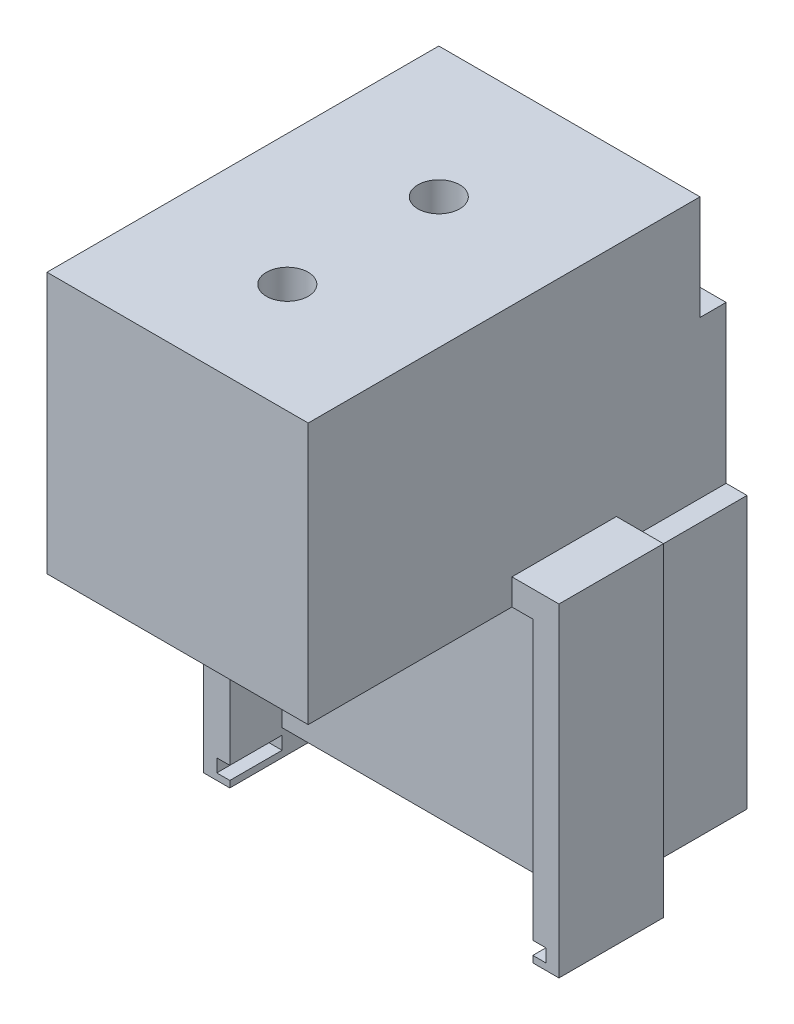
ISO-10303-21;
HEADER;
FILE_DESCRIPTION(('STEP AP214'),'2;1');
FILE_NAME('part.step','',(''),(''),'','','');
FILE_SCHEMA(('AUTOMOTIVE_DESIGN { 1 0 10303 214 1 1 1 1 }'));
ENDSEC;
DATA;
#1=APPLICATION_CONTEXT('core data for automotive mechanical design processes');
#2=APPLICATION_PROTOCOL_DEFINITION('international standard','automotive_design',2000,#1);
#3=PRODUCT_CONTEXT('',#1,'mechanical');
#4=PRODUCT('Part','Part','',(#3));
#5=PRODUCT_RELATED_PRODUCT_CATEGORY('part','',(#4));
#6=PRODUCT_DEFINITION_FORMATION('','',#4);
#7=PRODUCT_DEFINITION_CONTEXT('part definition',#1,'design');
#8=PRODUCT_DEFINITION('design','',#6,#7);
#9=PRODUCT_DEFINITION_SHAPE('','',#8);
#10=(LENGTH_UNIT() NAMED_UNIT(*) SI_UNIT(.MILLI.,.METRE.));
#11=(NAMED_UNIT(*) PLANE_ANGLE_UNIT() SI_UNIT($,.RADIAN.));
#12=(NAMED_UNIT(*) SI_UNIT($,.STERADIAN.) SOLID_ANGLE_UNIT());
#13=UNCERTAINTY_MEASURE_WITH_UNIT(LENGTH_MEASURE(1.E-05),#10,'distance_accuracy_value','');
#14=(GEOMETRIC_REPRESENTATION_CONTEXT(3) GLOBAL_UNCERTAINTY_ASSIGNED_CONTEXT((#13)) GLOBAL_UNIT_ASSIGNED_CONTEXT((#10,
#11,#12)) REPRESENTATION_CONTEXT('',''));
#15=CARTESIAN_POINT('',(0.,0.,0.));
#16=DIRECTION('',(0.,0.,1.));
#17=DIRECTION('',(1.,0.,0.));
#18=AXIS2_PLACEMENT_3D('',#15,#16,#17);
#19=CARTESIAN_POINT('',(0.,50.,0.));
#20=DIRECTION('',(1.,0.,0.));
#21=DIRECTION('',(0.,0.,-1.));
#22=AXIS2_PLACEMENT_3D('',#19,#20,#21);
#23=PLANE('',#22);
#24=DIRECTION('',(0.,1.,0.));
#25=VECTOR('',#24,1.);
#26=CARTESIAN_POINT('',(0.,5.,-59.));
#27=LINE('',#26,#25);
#28=CARTESIAN_POINT('',(0.,0.,-59.));
#29=VERTEX_POINT('',#28);
#30=CARTESIAN_POINT('',(0.,5.,-59.));
#31=VERTEX_POINT('',#30);
#32=EDGE_CURVE('E446',#29,#31,#27,.T.);
#33=ORIENTED_EDGE('',*,*,#32,.T.);
#34=DIRECTION('',(0.,0.,1.));
#35=VECTOR('',#34,1.);
#36=CARTESIAN_POINT('',(0.,5.,-59.));
#37=LINE('',#36,#35);
#38=CARTESIAN_POINT('',(0.,5.,-39.));
#39=VERTEX_POINT('',#38);
#40=EDGE_CURVE('E485',#31,#39,#37,.T.);
#41=ORIENTED_EDGE('',*,*,#40,.T.);
#42=DIRECTION('',(0.,1.,0.));
#43=VECTOR('',#42,1.);
#44=CARTESIAN_POINT('',(0.,5.,-39.));
#45=LINE('',#44,#43);
#46=CARTESIAN_POINT('',(0.,0.,-39.));
#47=VERTEX_POINT('',#46);
#48=EDGE_CURVE('E407',#47,#39,#45,.T.);
#49=ORIENTED_EDGE('',*,*,#48,.F.);
#50=DIRECTION('',(0.,0.,1.));
#51=VECTOR('',#50,1.);
#52=CARTESIAN_POINT('',(0.,0.,0.));
#53=LINE('',#52,#51);
#54=CARTESIAN_POINT('',(0.,0.,0.));
#55=VERTEX_POINT('',#54);
#56=EDGE_CURVE('E596',#47,#55,#53,.T.);
#57=ORIENTED_EDGE('',*,*,#56,.T.);
#58=DIRECTION('',(0.,-1.,0.));
#59=VECTOR('',#58,1.);
#60=CARTESIAN_POINT('',(0.,50.,0.));
#61=LINE('',#60,#59);
#62=CARTESIAN_POINT('',(0.,50.,0.));
#63=VERTEX_POINT('',#62);
#64=EDGE_CURVE('E607',#63,#55,#61,.T.);
#65=ORIENTED_EDGE('',*,*,#64,.F.);
#66=DIRECTION('',(0.,0.,1.));
#67=VECTOR('',#66,1.);
#68=CARTESIAN_POINT('',(0.,50.,0.));
#69=LINE('',#68,#67);
#70=CARTESIAN_POINT('',(0.,50.,-75.));
#71=VERTEX_POINT('',#70);
#72=EDGE_CURVE('E584',#71,#63,#69,.T.);
#73=ORIENTED_EDGE('',*,*,#72,.F.);
#74=DIRECTION('',(0.,1.,0.));
#75=VECTOR('',#74,1.);
#76=CARTESIAN_POINT('',(0.,50.,-75.));
#77=LINE('',#76,#75);
#78=CARTESIAN_POINT('',(0.,30.,-75.));
#79=VERTEX_POINT('',#78);
#80=EDGE_CURVE('E546',#79,#71,#77,.T.);
#81=ORIENTED_EDGE('',*,*,#80,.F.);
#82=DIRECTION('',(0.,0.,1.));
#83=VECTOR('',#82,1.);
#84=CARTESIAN_POINT('',(0.,30.,-75.));
#85=LINE('',#84,#83);
#86=CARTESIAN_POINT('',(0.,30.,-80.));
#87=VERTEX_POINT('',#86);
#88=EDGE_CURVE('E552',#87,#79,#85,.T.);
#89=ORIENTED_EDGE('',*,*,#88,.F.);
#90=DIRECTION('',(0.,-1.,0.));
#91=VECTOR('',#90,1.);
#92=CARTESIAN_POINT('',(0.,50.,-80.));
#93=LINE('',#92,#91);
#94=CARTESIAN_POINT('',(0.,0.,-80.));
#95=VERTEX_POINT('',#94);
#96=EDGE_CURVE('E611',#87,#95,#93,.T.);
#97=ORIENTED_EDGE('',*,*,#96,.T.);
#98=EDGE_CURVE('E597',#95,#29,#53,.T.);
#99=ORIENTED_EDGE('',*,*,#98,.T.);
#100=EDGE_LOOP('',(#33,#41,#49,#57,#65,#73,#81,#89,#97,#99));
#101=FACE_BOUND('',#100,.T.);
#102=ADVANCED_FACE('F47',(#101),#23,.F.);
#103=CARTESIAN_POINT('',(54.,0.,-80.));
#104=DIRECTION('',(0.,-1.,0.));
#105=DIRECTION('',(0.,0.,-1.));
#106=AXIS2_PLACEMENT_3D('',#103,#104,#105);
#107=PLANE('',#106);
#108=DIRECTION('',(1.,0.,0.));
#109=VECTOR('',#108,1.);
#110=CARTESIAN_POINT('',(0.,0.,-59.));
#111=LINE('',#110,#109);
#112=CARTESIAN_POINT('',(-3.99999999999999,0.,-59.));
#113=VERTEX_POINT('',#112);
#114=EDGE_CURVE('E442',#113,#29,#111,.T.);
#115=ORIENTED_EDGE('',*,*,#114,.T.);
#116=ORIENTED_EDGE('',*,*,#98,.F.);
#117=DIRECTION('',(-1.,0.,0.));
#118=VECTOR('',#117,1.);
#119=CARTESIAN_POINT('',(54.,0.,-80.));
#120=LINE('',#119,#118);
#121=CARTESIAN_POINT('',(-4.,0.,-80.));
#122=VERTEX_POINT('',#121);
#123=EDGE_CURVE('E538',#95,#122,#120,.T.);
#124=ORIENTED_EDGE('',*,*,#123,.T.);
#125=DIRECTION('',(0.,0.,1.));
#126=VECTOR('',#125,1.);
#127=CARTESIAN_POINT('',(-4.,0.,-80.));
#128=LINE('',#127,#126);
#129=EDGE_CURVE('E503',#122,#113,#128,.T.);
#130=ORIENTED_EDGE('',*,*,#129,.T.);
#131=EDGE_LOOP('',(#115,#116,#124,#130));
#132=FACE_BOUND('',#131,.T.);
#133=ADVANCED_FACE('F672',(#132),#107,.F.);
#134=CARTESIAN_POINT('',(-3.99999999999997,0.,0.));
#135=DIRECTION('',(-1.,0.,0.));
#136=DIRECTION('',(0.,0.,1.));
#137=AXIS2_PLACEMENT_3D('',#134,#135,#136);
#138=PLANE('',#137);
#139=DIRECTION('',(0.,0.,-1.));
#140=VECTOR('',#139,1.);
#141=CARTESIAN_POINT('',(-4.,-52.,-80.));
#142=LINE('',#141,#140);
#143=CARTESIAN_POINT('',(-3.99999999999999,-52.,-59.));
#144=VERTEX_POINT('',#143);
#145=CARTESIAN_POINT('',(-4.,-52.,-80.));
#146=VERTEX_POINT('',#145);
#147=EDGE_CURVE('E511',#144,#146,#142,.T.);
#148=ORIENTED_EDGE('',*,*,#147,.F.);
#149=DIRECTION('',(0.,1.,0.));
#150=VECTOR('',#149,1.);
#151=CARTESIAN_POINT('',(-3.99999999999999,0.,-59.));
#152=LINE('',#151,#150);
#153=EDGE_CURVE('E12',#144,#113,#152,.T.);
#154=ORIENTED_EDGE('',*,*,#153,.T.);
#155=ORIENTED_EDGE('',*,*,#129,.F.);
#156=DIRECTION('',(0.,1.,0.));
#157=VECTOR('',#156,1.);
#158=CARTESIAN_POINT('',(-4.,0.,-80.));
#159=LINE('',#158,#157);
#160=EDGE_CURVE('E499',#146,#122,#159,.T.);
#161=ORIENTED_EDGE('',*,*,#160,.F.);
#162=EDGE_LOOP('',(#148,#154,#155,#161));
#163=FACE_BOUND('',#162,.T.);
#164=ADVANCED_FACE('F670',(#163),#138,.T.);
#165=CARTESIAN_POINT('',(25.,50.,-21.));
#166=DIRECTION('',(0.,-1.,0.));
#167=DIRECTION('',(0.,0.,-1.));
#168=AXIS2_PLACEMENT_3D('',#165,#166,#167);
#169=CYLINDRICAL_SURFACE('',#168,4.);
#170=CARTESIAN_POINT('',(25.,50.,-21.));
#171=DIRECTION('',(0.,1.,0.));
#172=DIRECTION('',(0.,0.,1.));
#173=AXIS2_PLACEMENT_3D('',#170,#171,#172);
#174=CIRCLE('',#173,4.);
#175=CARTESIAN_POINT('',(25.,50.,-17.));
#176=VERTEX_POINT('',#175);
#177=EDGE_CURVE('E572',#176,#176,#174,.T.);
#178=ORIENTED_EDGE('',*,*,#177,.T.);
#179=EDGE_LOOP('',(#178));
#180=FACE_BOUND('',#179,.T.);
#181=CARTESIAN_POINT('',(25.,25.,-21.));
#182=DIRECTION('',(0.,-1.,0.));
#183=DIRECTION('',(0.,0.,-1.));
#184=AXIS2_PLACEMENT_3D('',#181,#182,#183);
#185=CIRCLE('',#184,4.);
#186=CARTESIAN_POINT('',(25.,25.,-25.));
#187=VERTEX_POINT('',#186);
#188=EDGE_CURVE('E495',#187,#187,#185,.T.);
#189=ORIENTED_EDGE('',*,*,#188,.T.);
#190=EDGE_LOOP('',(#189));
#191=FACE_BOUND('',#190,.T.);
#192=ADVANCED_FACE('F49',(#180,#191),#169,.F.);
#193=CARTESIAN_POINT('',(0.,0.,0.));
#194=DIRECTION('',(0.,1.,0.));
#195=DIRECTION('',(0.,0.,1.));
#196=AXIS2_PLACEMENT_3D('',#193,#194,#195);
#197=PLANE('',#196);
#198=CARTESIAN_POINT('',(25.,0.,-21.));
#199=DIRECTION('',(0.,-1.,0.));
#200=DIRECTION('',(0.,0.,-1.));
#201=AXIS2_PLACEMENT_3D('',#198,#199,#200);
#202=CIRCLE('',#201,7.5);
#203=CARTESIAN_POINT('',(25.,0.,-28.5));
#204=VERTEX_POINT('',#203);
#205=EDGE_CURVE('E466',#204,#204,#202,.T.);
#206=ORIENTED_EDGE('',*,*,#205,.F.);
#207=EDGE_LOOP('',(#206));
#208=FACE_BOUND('',#207,.T.);
#209=DIRECTION('',(-1.,0.,0.));
#210=VECTOR('',#209,1.);
#211=CARTESIAN_POINT('',(54.,0.,-49.));
#212=LINE('',#211,#210);
#213=CARTESIAN_POINT('',(54.,0.,-49.));
#214=VERTEX_POINT('',#213);
#215=CARTESIAN_POINT('',(-3.99999999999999,0.,-49.));
#216=VERTEX_POINT('',#215);
#217=EDGE_CURVE('E56',#214,#216,#212,.T.);
#218=ORIENTED_EDGE('',*,*,#217,.F.);
#219=DIRECTION('',(0.,0.,1.));
#220=VECTOR('',#219,1.);
#221=CARTESIAN_POINT('',(54.,0.,-59.));
#222=LINE('',#221,#220);
#223=CARTESIAN_POINT('',(54.,0.,-39.));
#224=VERTEX_POINT('',#223);
#225=EDGE_CURVE('E324',#214,#224,#222,.T.);
#226=ORIENTED_EDGE('',*,*,#225,.T.);
#227=DIRECTION('',(1.,0.,0.));
#228=VECTOR('',#227,1.);
#229=CARTESIAN_POINT('',(50.,0.,-39.));
#230=LINE('',#229,#228);
#231=CARTESIAN_POINT('',(50.,0.,-39.));
#232=VERTEX_POINT('',#231);
#233=EDGE_CURVE('E377',#232,#224,#230,.T.);
#234=ORIENTED_EDGE('',*,*,#233,.F.);
#235=DIRECTION('',(0.,0.,1.));
#236=VECTOR('',#235,1.);
#237=CARTESIAN_POINT('',(50.,0.,0.));
#238=LINE('',#237,#236);
#239=CARTESIAN_POINT('',(50.,0.,0.));
#240=VERTEX_POINT('',#239);
#241=EDGE_CURVE('E565',#232,#240,#238,.T.);
#242=ORIENTED_EDGE('',*,*,#241,.T.);
#243=DIRECTION('',(1.,0.,0.));
#244=VECTOR('',#243,1.);
#245=CARTESIAN_POINT('',(0.,0.,0.));
#246=LINE('',#245,#244);
#247=EDGE_CURVE('E577',#55,#240,#246,.T.);
#248=ORIENTED_EDGE('',*,*,#247,.F.);
#249=ORIENTED_EDGE('',*,*,#56,.F.);
#250=DIRECTION('',(1.,0.,0.));
#251=VECTOR('',#250,1.);
#252=CARTESIAN_POINT('',(0.,0.,-39.));
#253=LINE('',#252,#251);
#254=CARTESIAN_POINT('',(-3.99999999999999,0.,-39.));
#255=VERTEX_POINT('',#254);
#256=EDGE_CURVE('E404',#255,#47,#253,.T.);
#257=ORIENTED_EDGE('',*,*,#256,.F.);
#258=DIRECTION('',(0.,0.,1.));
#259=VECTOR('',#258,1.);
#260=CARTESIAN_POINT('',(-3.99999999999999,0.,-59.));
#261=LINE('',#260,#259);
#262=EDGE_CURVE('E462',#216,#255,#261,.T.);
#263=ORIENTED_EDGE('',*,*,#262,.F.);
#264=EDGE_LOOP('',(#218,#226,#234,#242,#248,#249,#257,#263));
#265=FACE_BOUND('',#264,.T.);
#266=ADVANCED_FACE('F638',(#208,#265),#197,.F.);
#267=CARTESIAN_POINT('',(50.,50.,0.));
#268=DIRECTION('',(1.,0.,0.));
#269=DIRECTION('',(0.,0.,-1.));
#270=AXIS2_PLACEMENT_3D('',#267,#268,#269);
#271=PLANE('',#270);
#272=DIRECTION('',(0.,-1.,0.));
#273=VECTOR('',#272,1.);
#274=CARTESIAN_POINT('',(50.,5.,-59.));
#275=LINE('',#274,#273);
#276=CARTESIAN_POINT('',(50.,5.,-59.));
#277=VERTEX_POINT('',#276);
#278=CARTESIAN_POINT('',(50.,0.,-59.));
#279=VERTEX_POINT('',#278);
#280=EDGE_CURVE('E343',#277,#279,#275,.T.);
#281=ORIENTED_EDGE('',*,*,#280,.T.);
#282=CARTESIAN_POINT('',(50.,0.,-80.));
#283=VERTEX_POINT('',#282);
#284=EDGE_CURVE('E592',#283,#279,#238,.T.);
#285=ORIENTED_EDGE('',*,*,#284,.F.);
#286=DIRECTION('',(0.,-1.,0.));
#287=VECTOR('',#286,1.);
#288=CARTESIAN_POINT('',(50.,50.,-80.));
#289=LINE('',#288,#287);
#290=CARTESIAN_POINT('',(50.,30.,-80.));
#291=VERTEX_POINT('',#290);
#292=EDGE_CURVE('E614',#291,#283,#289,.T.);
#293=ORIENTED_EDGE('',*,*,#292,.F.);
#294=DIRECTION('',(0.,0.,1.));
#295=VECTOR('',#294,1.);
#296=CARTESIAN_POINT('',(50.,30.,-75.));
#297=LINE('',#296,#295);
#298=CARTESIAN_POINT('',(50.,30.,-75.));
#299=VERTEX_POINT('',#298);
#300=EDGE_CURVE('E551',#291,#299,#297,.T.);
#301=ORIENTED_EDGE('',*,*,#300,.T.);
#302=DIRECTION('',(0.,1.,0.));
#303=VECTOR('',#302,1.);
#304=CARTESIAN_POINT('',(50.,50.,-75.));
#305=LINE('',#304,#303);
#306=CARTESIAN_POINT('',(50.,50.,-75.));
#307=VERTEX_POINT('',#306);
#308=EDGE_CURVE('E547',#299,#307,#305,.T.);
#309=ORIENTED_EDGE('',*,*,#308,.T.);
#310=DIRECTION('',(0.,0.,1.));
#311=VECTOR('',#310,1.);
#312=CARTESIAN_POINT('',(50.,50.,0.));
#313=LINE('',#312,#311);
#314=CARTESIAN_POINT('',(50.,50.,0.));
#315=VERTEX_POINT('',#314);
#316=EDGE_CURVE('E581',#307,#315,#313,.T.);
#317=ORIENTED_EDGE('',*,*,#316,.T.);
#318=DIRECTION('',(0.,-1.,0.));
#319=VECTOR('',#318,1.);
#320=CARTESIAN_POINT('',(50.,50.,0.));
#321=LINE('',#320,#319);
#322=EDGE_CURVE('E591',#315,#240,#321,.T.);
#323=ORIENTED_EDGE('',*,*,#322,.T.);
#324=ORIENTED_EDGE('',*,*,#241,.F.);
#325=DIRECTION('',(0.,-1.,0.));
#326=VECTOR('',#325,1.);
#327=CARTESIAN_POINT('',(50.,5.,-39.));
#328=LINE('',#327,#326);
#329=CARTESIAN_POINT('',(50.,5.,-39.));
#330=VERTEX_POINT('',#329);
#331=EDGE_CURVE('E381',#330,#232,#328,.T.);
#332=ORIENTED_EDGE('',*,*,#331,.F.);
#333=DIRECTION('',(0.,0.,1.));
#334=VECTOR('',#333,1.);
#335=CARTESIAN_POINT('',(50.,5.,-59.));
#336=LINE('',#335,#334);
#337=EDGE_CURVE('E321',#277,#330,#336,.T.);
#338=ORIENTED_EDGE('',*,*,#337,.F.);
#339=EDGE_LOOP('',(#281,#285,#293,#301,#309,#317,#323,#324,#332,#338));
#340=FACE_BOUND('',#339,.T.);
#341=ADVANCED_FACE('F641',(#340),#271,.T.);
#342=CARTESIAN_POINT('',(0.,50.,-80.));
#343=DIRECTION('',(0.,0.,-1.));
#344=DIRECTION('',(-1.,0.,0.));
#345=AXIS2_PLACEMENT_3D('',#342,#343,#344);
#346=PLANE('',#345);
#347=DIRECTION('',(-1.,0.,0.));
#348=VECTOR('',#347,1.);
#349=CARTESIAN_POINT('',(50.,30.,-80.));
#350=LINE('',#349,#348);
#351=EDGE_CURVE('E566',#291,#87,#350,.T.);
#352=ORIENTED_EDGE('',*,*,#351,.F.);
#353=ORIENTED_EDGE('',*,*,#292,.T.);
#354=CARTESIAN_POINT('',(54.,0.,-80.));
#355=VERTEX_POINT('',#354);
#356=EDGE_CURVE('E542',#355,#283,#120,.T.);
#357=ORIENTED_EDGE('',*,*,#356,.F.);
#358=DIRECTION('',(0.,1.,0.));
#359=VECTOR('',#358,1.);
#360=CARTESIAN_POINT('',(54.,0.,-80.));
#361=LINE('',#360,#359);
#362=CARTESIAN_POINT('',(54.,-52.,-80.));
#363=VERTEX_POINT('',#362);
#364=EDGE_CURVE('E516',#363,#355,#361,.T.);
#365=ORIENTED_EDGE('',*,*,#364,.F.);
#366=DIRECTION('',(-1.,0.,0.));
#367=VECTOR('',#366,1.);
#368=CARTESIAN_POINT('',(54.,-52.,-80.));
#369=LINE('',#368,#367);
#370=EDGE_CURVE('E530',#363,#146,#369,.T.);
#371=ORIENTED_EDGE('',*,*,#370,.T.);
#372=ORIENTED_EDGE('',*,*,#160,.T.);
#373=ORIENTED_EDGE('',*,*,#123,.F.);
#374=ORIENTED_EDGE('',*,*,#96,.F.);
#375=EDGE_LOOP('',(#352,#353,#357,#365,#371,#372,#373,#374));
#376=FACE_BOUND('',#375,.T.);
#377=ADVANCED_FACE('F666',(#376),#346,.T.);
#378=CARTESIAN_POINT('',(25.,50.,-50.));
#379=DIRECTION('',(0.,-1.,0.));
#380=DIRECTION('',(0.,0.,-1.));
#381=AXIS2_PLACEMENT_3D('',#378,#379,#380);
#382=CYLINDRICAL_SURFACE('',#381,3.99999999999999);
#383=CARTESIAN_POINT('',(25.,10.,-50.));
#384=DIRECTION('',(0.,1.,0.));
#385=DIRECTION('',(0.,0.,1.));
#386=AXIS2_PLACEMENT_3D('',#383,#384,#385);
#387=CIRCLE('',#386,3.99999999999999);
#388=CARTESIAN_POINT('',(25.,10.,-46.));
#389=VERTEX_POINT('',#388);
#390=EDGE_CURVE('E541',#389,#389,#387,.T.);
#391=ORIENTED_EDGE('',*,*,#390,.F.);
#392=EDGE_LOOP('',(#391));
#393=FACE_BOUND('',#392,.T.);
#394=CARTESIAN_POINT('',(25.,50.,-50.));
#395=DIRECTION('',(0.,1.,0.));
#396=DIRECTION('',(0.,0.,1.));
#397=AXIS2_PLACEMENT_3D('',#394,#395,#396);
#398=CIRCLE('',#397,3.99999999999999);
#399=CARTESIAN_POINT('',(25.,50.,-46.));
#400=VERTEX_POINT('',#399);
#401=EDGE_CURVE('E576',#400,#400,#398,.T.);
#402=ORIENTED_EDGE('',*,*,#401,.T.);
#403=EDGE_LOOP('',(#402));
#404=FACE_BOUND('',#403,.T.);
#405=ADVANCED_FACE('F724',(#393,#404),#382,.F.);
#406=CARTESIAN_POINT('',(0.,50.,0.));
#407=DIRECTION('',(0.,0.,-1.));
#408=DIRECTION('',(-1.,0.,0.));
#409=AXIS2_PLACEMENT_3D('',#406,#407,#408);
#410=PLANE('',#409);
#411=ORIENTED_EDGE('',*,*,#64,.T.);
#412=ORIENTED_EDGE('',*,*,#247,.T.);
#413=ORIENTED_EDGE('',*,*,#322,.F.);
#414=DIRECTION('',(1.,0.,0.));
#415=VECTOR('',#414,1.);
#416=CARTESIAN_POINT('',(0.,50.,0.));
#417=LINE('',#416,#415);
#418=EDGE_CURVE('E587',#63,#315,#417,.T.);
#419=ORIENTED_EDGE('',*,*,#418,.F.);
#420=EDGE_LOOP('',(#411,#412,#413,#419));
#421=FACE_BOUND('',#420,.T.);
#422=ADVANCED_FACE('F686',(#421),#410,.F.);
#423=CARTESIAN_POINT('',(0.,50.,0.));
#424=DIRECTION('',(0.,1.,0.));
#425=DIRECTION('',(0.,0.,1.));
#426=AXIS2_PLACEMENT_3D('',#423,#424,#425);
#427=PLANE('',#426);
#428=DIRECTION('',(-1.,0.,0.));
#429=VECTOR('',#428,1.);
#430=CARTESIAN_POINT('',(50.,50.,-75.));
#431=LINE('',#430,#429);
#432=EDGE_CURVE('E556',#307,#71,#431,.T.);
#433=ORIENTED_EDGE('',*,*,#432,.T.);
#434=ORIENTED_EDGE('',*,*,#72,.T.);
#435=ORIENTED_EDGE('',*,*,#418,.T.);
#436=ORIENTED_EDGE('',*,*,#316,.F.);
#437=EDGE_LOOP('',(#433,#434,#435,#436));
#438=FACE_BOUND('',#437,.T.);
#439=ORIENTED_EDGE('',*,*,#177,.F.);
#440=EDGE_LOOP('',(#439));
#441=FACE_BOUND('',#440,.T.);
#442=ORIENTED_EDGE('',*,*,#401,.F.);
#443=EDGE_LOOP('',(#442));
#444=FACE_BOUND('',#443,.T.);
#445=ADVANCED_FACE('F694',(#438,#441,#444),#427,.T.);
#446=CARTESIAN_POINT('',(50.,50.,-75.));
#447=DIRECTION('',(0.,0.,1.));
#448=DIRECTION('',(1.,0.,0.));
#449=AXIS2_PLACEMENT_3D('',#446,#447,#448);
#450=PLANE('',#449);
#451=ORIENTED_EDGE('',*,*,#80,.T.);
#452=ORIENTED_EDGE('',*,*,#432,.F.);
#453=ORIENTED_EDGE('',*,*,#308,.F.);
#454=DIRECTION('',(-1.,0.,0.));
#455=VECTOR('',#454,1.);
#456=CARTESIAN_POINT('',(50.,30.,-75.));
#457=LINE('',#456,#455);
#458=EDGE_CURVE('E562',#299,#79,#457,.T.);
#459=ORIENTED_EDGE('',*,*,#458,.T.);
#460=EDGE_LOOP('',(#451,#452,#453,#459));
#461=FACE_BOUND('',#460,.T.);
#462=ADVANCED_FACE('F699',(#461),#450,.F.);
#463=CARTESIAN_POINT('',(50.,30.,-75.));
#464=DIRECTION('',(0.,-1.,0.));
#465=DIRECTION('',(0.,0.,-1.));
#466=AXIS2_PLACEMENT_3D('',#463,#464,#465);
#467=PLANE('',#466);
#468=ORIENTED_EDGE('',*,*,#88,.T.);
#469=ORIENTED_EDGE('',*,*,#458,.F.);
#470=ORIENTED_EDGE('',*,*,#300,.F.);
#471=ORIENTED_EDGE('',*,*,#351,.T.);
#472=EDGE_LOOP('',(#468,#469,#470,#471));
#473=FACE_BOUND('',#472,.T.);
#474=ADVANCED_FACE('F701',(#473),#467,.F.);
#475=CARTESIAN_POINT('',(0.,10.,0.));
#476=DIRECTION('',(0.,1.,0.));
#477=DIRECTION('',(0.,0.,1.));
#478=AXIS2_PLACEMENT_3D('',#475,#476,#477);
#479=PLANE('',#478);
#480=ORIENTED_EDGE('',*,*,#390,.T.);
#481=EDGE_LOOP('',(#480));
#482=FACE_BOUND('',#481,.T.);
#483=ADVANCED_FACE('F744',(#482),#479,.T.);
#484=ORIENTED_EDGE('',*,*,#284,.T.);
#485=DIRECTION('',(1.,0.,0.));
#486=VECTOR('',#485,1.);
#487=CARTESIAN_POINT('',(50.,0.,-59.));
#488=LINE('',#487,#486);
#489=CARTESIAN_POINT('',(54.,0.,-59.));
#490=VERTEX_POINT('',#489);
#491=EDGE_CURVE('E339',#279,#490,#488,.T.);
#492=ORIENTED_EDGE('',*,*,#491,.T.);
#493=DIRECTION('',(0.,0.,1.));
#494=VECTOR('',#493,1.);
#495=CARTESIAN_POINT('',(54.,0.,-80.));
#496=LINE('',#495,#494);
#497=EDGE_CURVE('E520',#355,#490,#496,.T.);
#498=ORIENTED_EDGE('',*,*,#497,.F.);
#499=ORIENTED_EDGE('',*,*,#356,.T.);
#500=EDGE_LOOP('',(#484,#492,#498,#499));
#501=FACE_BOUND('',#500,.T.);
#502=ADVANCED_FACE('F706',(#501),#107,.F.);
#503=CARTESIAN_POINT('',(54.,0.,-49.));
#504=DIRECTION('',(0.,0.,-1.));
#505=DIRECTION('',(-1.,0.,0.));
#506=AXIS2_PLACEMENT_3D('',#503,#504,#505);
#507=PLANE('',#506);
#508=DIRECTION('',(0.,-1.,0.));
#509=VECTOR('',#508,1.);
#510=CARTESIAN_POINT('',(54.,0.,-49.));
#511=LINE('',#510,#509);
#512=CARTESIAN_POINT('',(54.,-52.,-49.));
#513=VERTEX_POINT('',#512);
#514=EDGE_CURVE('E524',#214,#513,#511,.T.);
#515=ORIENTED_EDGE('',*,*,#514,.F.);
#516=ORIENTED_EDGE('',*,*,#217,.T.);
#517=DIRECTION('',(0.,-1.,0.));
#518=VECTOR('',#517,1.);
#519=CARTESIAN_POINT('',(-3.99999999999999,0.,-49.));
#520=LINE('',#519,#518);
#521=CARTESIAN_POINT('',(-3.99999999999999,-52.,-49.));
#522=VERTEX_POINT('',#521);
#523=EDGE_CURVE('E507',#216,#522,#520,.T.);
#524=ORIENTED_EDGE('',*,*,#523,.T.);
#525=DIRECTION('',(-1.,0.,0.));
#526=VECTOR('',#525,1.);
#527=CARTESIAN_POINT('',(54.,-52.,-49.));
#528=LINE('',#527,#526);
#529=EDGE_CURVE('E534',#513,#522,#528,.T.);
#530=ORIENTED_EDGE('',*,*,#529,.F.);
#531=EDGE_LOOP('',(#515,#516,#524,#530));
#532=FACE_BOUND('',#531,.T.);
#533=ADVANCED_FACE('F652',(#532),#507,.F.);
#534=CARTESIAN_POINT('',(54.,-52.,-80.));
#535=DIRECTION('',(0.,1.,0.));
#536=DIRECTION('',(0.,0.,1.));
#537=AXIS2_PLACEMENT_3D('',#534,#535,#536);
#538=PLANE('',#537);
#539=ORIENTED_EDGE('',*,*,#529,.T.);
#540=EDGE_CURVE('E512',#522,#144,#142,.T.);
#541=ORIENTED_EDGE('',*,*,#540,.T.);
#542=ORIENTED_EDGE('',*,*,#147,.T.);
#543=ORIENTED_EDGE('',*,*,#370,.F.);
#544=DIRECTION('',(0.,0.,-1.));
#545=VECTOR('',#544,1.);
#546=CARTESIAN_POINT('',(54.,-52.,-80.));
#547=LINE('',#546,#545);
#548=CARTESIAN_POINT('',(54.,-52.,-59.));
#549=VERTEX_POINT('',#548);
#550=EDGE_CURVE('E527',#549,#363,#547,.T.);
#551=ORIENTED_EDGE('',*,*,#550,.F.);
#552=EDGE_CURVE('E265',#513,#549,#547,.T.);
#553=ORIENTED_EDGE('',*,*,#552,.F.);
#554=EDGE_LOOP('',(#539,#541,#542,#543,#551,#553));
#555=FACE_BOUND('',#554,.T.);
#556=ADVANCED_FACE('F655',(#555),#538,.F.);
#557=CARTESIAN_POINT('',(54.,0.,0.));
#558=DIRECTION('',(-1.,0.,0.));
#559=DIRECTION('',(0.,0.,1.));
#560=AXIS2_PLACEMENT_3D('',#557,#558,#559);
#561=PLANE('',#560);
#562=ORIENTED_EDGE('',*,*,#497,.T.);
#563=DIRECTION('',(0.,-1.,0.));
#564=VECTOR('',#563,1.);
#565=CARTESIAN_POINT('',(54.,0.,-59.));
#566=LINE('',#565,#564);
#567=EDGE_CURVE('E269',#490,#549,#566,.T.);
#568=ORIENTED_EDGE('',*,*,#567,.T.);
#569=ORIENTED_EDGE('',*,*,#550,.T.);
#570=ORIENTED_EDGE('',*,*,#364,.T.);
#571=EDGE_LOOP('',(#562,#568,#569,#570));
#572=FACE_BOUND('',#571,.T.);
#573=ADVANCED_FACE('F634',(#572),#561,.F.);
#574=CARTESIAN_POINT('',(25.,25.,-21.));
#575=DIRECTION('',(0.,-1.,0.));
#576=DIRECTION('',(0.,0.,-1.));
#577=AXIS2_PLACEMENT_3D('',#574,#575,#576);
#578=CYLINDRICAL_SURFACE('',#577,7.5);
#579=CARTESIAN_POINT('',(25.,25.,-21.));
#580=DIRECTION('',(0.,-1.,0.));
#581=DIRECTION('',(0.,0.,-1.));
#582=AXIS2_PLACEMENT_3D('',#579,#580,#581);
#583=CIRCLE('',#582,7.5);
#584=CARTESIAN_POINT('',(25.,25.,-28.5));
#585=VERTEX_POINT('',#584);
#586=EDGE_CURVE('E491',#585,#585,#583,.T.);
#587=ORIENTED_EDGE('',*,*,#586,.F.);
#588=EDGE_LOOP('',(#587));
#589=FACE_BOUND('',#588,.T.);
#590=ORIENTED_EDGE('',*,*,#205,.T.);
#591=EDGE_LOOP('',(#590));
#592=FACE_BOUND('',#591,.T.);
#593=ADVANCED_FACE('F628',(#589,#592),#578,.F.);
#594=CARTESIAN_POINT('',(25.,25.,-21.));
#595=DIRECTION('',(0.,-1.,0.));
#596=DIRECTION('',(0.,0.,-1.));
#597=AXIS2_PLACEMENT_3D('',#594,#595,#596);
#598=PLANE('',#597);
#599=ORIENTED_EDGE('',*,*,#188,.F.);
#600=EDGE_LOOP('',(#599));
#601=FACE_BOUND('',#600,.T.);
#602=ORIENTED_EDGE('',*,*,#586,.T.);
#603=EDGE_LOOP('',(#602));
#604=FACE_BOUND('',#603,.T.);
#605=ADVANCED_FACE('F624',(#601,#604),#598,.T.);
#606=CARTESIAN_POINT('',(-3.99999999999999,-53.25,-59.));
#607=DIRECTION('',(1.,0.,0.));
#608=DIRECTION('',(0.,0.,-1.));
#609=AXIS2_PLACEMENT_3D('',#606,#607,#608);
#610=PLANE('',#609);
#611=ORIENTED_EDGE('',*,*,#523,.F.);
#612=ORIENTED_EDGE('',*,*,#262,.T.);
#613=DIRECTION('',(0.,1.,0.));
#614=VECTOR('',#613,1.);
#615=CARTESIAN_POINT('',(-3.99999999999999,-53.25,-39.));
#616=LINE('',#615,#614);
#617=CARTESIAN_POINT('',(-3.99999999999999,-53.25,-39.));
#618=VERTEX_POINT('',#617);
#619=EDGE_CURVE('E400',#618,#255,#616,.T.);
#620=ORIENTED_EDGE('',*,*,#619,.F.);
#621=DIRECTION('',(0.,0.,1.));
#622=VECTOR('',#621,1.);
#623=CARTESIAN_POINT('',(-3.99999999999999,-53.25,-59.));
#624=LINE('',#623,#622);
#625=CARTESIAN_POINT('',(-3.99999999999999,-53.25,-49.));
#626=VERTEX_POINT('',#625);
#627=EDGE_CURVE('E463',#626,#618,#624,.T.);
#628=ORIENTED_EDGE('',*,*,#627,.F.);
#629=DIRECTION('',(0.,1.,0.));
#630=VECTOR('',#629,1.);
#631=CARTESIAN_POINT('',(-4.00000000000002,-53.25,-49.));
#632=LINE('',#631,#630);
#633=CARTESIAN_POINT('',(-4.00000000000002,-55.75,-49.));
#634=VERTEX_POINT('',#633);
#635=EDGE_CURVE('E304',#634,#626,#632,.T.);
#636=ORIENTED_EDGE('',*,*,#635,.F.);
#637=DIRECTION('',(0.,0.,1.));
#638=VECTOR('',#637,1.);
#639=CARTESIAN_POINT('',(-4.00000000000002,-55.75,-59.));
#640=LINE('',#639,#638);
#641=CARTESIAN_POINT('',(-4.00000000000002,-55.75,-39.));
#642=VERTEX_POINT('',#641);
#643=EDGE_CURVE('E473',#634,#642,#640,.T.);
#644=ORIENTED_EDGE('',*,*,#643,.T.);
#645=DIRECTION('',(0.,1.,0.));
#646=VECTOR('',#645,1.);
#647=CARTESIAN_POINT('',(-4.00000000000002,-55.75,-39.));
#648=LINE('',#647,#646);
#649=CARTESIAN_POINT('',(-3.99999999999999,-57.,-39.));
#650=VERTEX_POINT('',#649);
#651=EDGE_CURVE('E422',#650,#642,#648,.T.);
#652=ORIENTED_EDGE('',*,*,#651,.F.);
#653=DIRECTION('',(0.,0.,1.));
#654=VECTOR('',#653,1.);
#655=CARTESIAN_POINT('',(-3.99999999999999,-57.,-59.));
#656=LINE('',#655,#654);
#657=CARTESIAN_POINT('',(-3.99999999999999,-57.,-59.));
#658=VERTEX_POINT('',#657);
#659=EDGE_CURVE('E476',#658,#650,#656,.T.);
#660=ORIENTED_EDGE('',*,*,#659,.F.);
#661=DIRECTION('',(0.,1.,0.));
#662=VECTOR('',#661,1.);
#663=CARTESIAN_POINT('',(-3.99999999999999,-53.25,-59.));
#664=LINE('',#663,#662);
#665=EDGE_CURVE('E438',#658,#144,#664,.T.);
#666=ORIENTED_EDGE('',*,*,#665,.T.);
#667=ORIENTED_EDGE('',*,*,#540,.F.);
#668=EDGE_LOOP('',(#611,#612,#620,#628,#636,#644,#652,#660,#666,#667));
#669=FACE_BOUND('',#668,.T.);
#670=ADVANCED_FACE('F627',(#669),#610,.T.);
#671=CARTESIAN_POINT('',(-3.99999999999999,-53.25,-59.));
#672=DIRECTION('',(0.,-1.,0.));
#673=DIRECTION('',(0.,0.,-1.));
#674=AXIS2_PLACEMENT_3D('',#671,#672,#673);
#675=PLANE('',#674);
#676=DIRECTION('',(-1.,0.,0.));
#677=VECTOR('',#676,1.);
#678=CARTESIAN_POINT('',(-6.49999999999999,-53.25,-49.));
#679=LINE('',#678,#677);
#680=CARTESIAN_POINT('',(-6.49999999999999,-53.25,-49.));
#681=VERTEX_POINT('',#680);
#682=EDGE_CURVE('E308',#626,#681,#679,.T.);
#683=ORIENTED_EDGE('',*,*,#682,.F.);
#684=ORIENTED_EDGE('',*,*,#627,.T.);
#685=DIRECTION('',(1.,0.,0.));
#686=VECTOR('',#685,1.);
#687=CARTESIAN_POINT('',(-3.99999999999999,-53.25,-39.));
#688=LINE('',#687,#686);
#689=CARTESIAN_POINT('',(-6.49999999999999,-53.25,-39.));
#690=VERTEX_POINT('',#689);
#691=EDGE_CURVE('E434',#690,#618,#688,.T.);
#692=ORIENTED_EDGE('',*,*,#691,.F.);
#693=DIRECTION('',(0.,0.,1.));
#694=VECTOR('',#693,1.);
#695=CARTESIAN_POINT('',(-6.49999999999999,-53.25,-59.));
#696=LINE('',#695,#694);
#697=EDGE_CURVE('E467',#681,#690,#696,.T.);
#698=ORIENTED_EDGE('',*,*,#697,.F.);
#699=EDGE_LOOP('',(#683,#684,#692,#698));
#700=FACE_BOUND('',#699,.T.);
#701=ADVANCED_FACE('F1038',(#700),#675,.T.);
#702=CARTESIAN_POINT('',(-6.49999999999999,-53.25,-59.));
#703=DIRECTION('',(1.,0.,0.));
#704=DIRECTION('',(0.,0.,-1.));
#705=AXIS2_PLACEMENT_3D('',#702,#703,#704);
#706=PLANE('',#705);
#707=DIRECTION('',(0.,-1.,0.));
#708=VECTOR('',#707,1.);
#709=CARTESIAN_POINT('',(-6.49999999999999,-53.25,-49.));
#710=LINE('',#709,#708);
#711=CARTESIAN_POINT('',(-6.49999999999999,-55.75,-49.));
#712=VERTEX_POINT('',#711);
#713=EDGE_CURVE('E296',#681,#712,#710,.T.);
#714=ORIENTED_EDGE('',*,*,#713,.F.);
#715=ORIENTED_EDGE('',*,*,#697,.T.);
#716=DIRECTION('',(0.,1.,0.));
#717=VECTOR('',#716,1.);
#718=CARTESIAN_POINT('',(-6.49999999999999,-53.25,-39.));
#719=LINE('',#718,#717);
#720=CARTESIAN_POINT('',(-6.49999999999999,-55.75,-39.));
#721=VERTEX_POINT('',#720);
#722=EDGE_CURVE('E430',#721,#690,#719,.T.);
#723=ORIENTED_EDGE('',*,*,#722,.F.);
#724=DIRECTION('',(0.,0.,1.));
#725=VECTOR('',#724,1.);
#726=CARTESIAN_POINT('',(-6.49999999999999,-55.75,-59.));
#727=LINE('',#726,#725);
#728=EDGE_CURVE('E470',#712,#721,#727,.T.);
#729=ORIENTED_EDGE('',*,*,#728,.F.);
#730=EDGE_LOOP('',(#714,#715,#723,#729));
#731=FACE_BOUND('',#730,.T.);
#732=ADVANCED_FACE('F1049',(#731),#706,.T.);
#733=CARTESIAN_POINT('',(-4.00000000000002,-55.75,-59.));
#734=DIRECTION('',(0.,1.,0.));
#735=DIRECTION('',(0.,0.,1.));
#736=AXIS2_PLACEMENT_3D('',#733,#734,#735);
#737=PLANE('',#736);
#738=DIRECTION('',(1.,0.,0.));
#739=VECTOR('',#738,1.);
#740=CARTESIAN_POINT('',(-6.49999999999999,-55.75,-49.));
#741=LINE('',#740,#739);
#742=EDGE_CURVE('E300',#712,#634,#741,.T.);
#743=ORIENTED_EDGE('',*,*,#742,.F.);
#744=ORIENTED_EDGE('',*,*,#728,.T.);
#745=DIRECTION('',(-1.,0.,0.));
#746=VECTOR('',#745,1.);
#747=CARTESIAN_POINT('',(-4.00000000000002,-55.75,-39.));
#748=LINE('',#747,#746);
#749=EDGE_CURVE('E426',#642,#721,#748,.T.);
#750=ORIENTED_EDGE('',*,*,#749,.F.);
#751=ORIENTED_EDGE('',*,*,#643,.F.);
#752=EDGE_LOOP('',(#743,#744,#750,#751));
#753=FACE_BOUND('',#752,.T.);
#754=ADVANCED_FACE('F924',(#753),#737,.T.);
#755=CARTESIAN_POINT('',(-8.99999999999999,-57.,-59.));
#756=DIRECTION('',(0.,-1.,0.));
#757=DIRECTION('',(0.,0.,-1.));
#758=AXIS2_PLACEMENT_3D('',#755,#756,#757);
#759=PLANE('',#758);
#760=ORIENTED_EDGE('',*,*,#659,.T.);
#761=DIRECTION('',(1.,0.,0.));
#762=VECTOR('',#761,1.);
#763=CARTESIAN_POINT('',(-8.99999999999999,-57.,-39.));
#764=LINE('',#763,#762);
#765=CARTESIAN_POINT('',(-8.99999999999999,-57.,-39.));
#766=VERTEX_POINT('',#765);
#767=EDGE_CURVE('E418',#766,#650,#764,.T.);
#768=ORIENTED_EDGE('',*,*,#767,.F.);
#769=DIRECTION('',(0.,0.,1.));
#770=VECTOR('',#769,1.);
#771=CARTESIAN_POINT('',(-8.99999999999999,-57.,-59.));
#772=LINE('',#771,#770);
#773=CARTESIAN_POINT('',(-8.99999999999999,-57.,-59.));
#774=VERTEX_POINT('',#773);
#775=EDGE_CURVE('E479',#774,#766,#772,.T.);
#776=ORIENTED_EDGE('',*,*,#775,.F.);
#777=DIRECTION('',(1.,0.,0.));
#778=VECTOR('',#777,1.);
#779=CARTESIAN_POINT('',(-8.99999999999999,-57.,-59.));
#780=LINE('',#779,#778);
#781=EDGE_CURVE('E458',#774,#658,#780,.T.);
#782=ORIENTED_EDGE('',*,*,#781,.T.);
#783=EDGE_LOOP('',(#760,#768,#776,#782));
#784=FACE_BOUND('',#783,.T.);
#785=ADVANCED_FACE('F918',(#784),#759,.T.);
#786=CARTESIAN_POINT('',(-8.99999999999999,5.,-59.));
#787=DIRECTION('',(-1.,0.,0.));
#788=DIRECTION('',(0.,0.,1.));
#789=AXIS2_PLACEMENT_3D('',#786,#787,#788);
#790=PLANE('',#789);
#791=ORIENTED_EDGE('',*,*,#775,.T.);
#792=DIRECTION('',(0.,-1.,0.));
#793=VECTOR('',#792,1.);
#794=CARTESIAN_POINT('',(-8.99999999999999,5.,-39.));
#795=LINE('',#794,#793);
#796=CARTESIAN_POINT('',(-8.99999999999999,5.,-39.));
#797=VERTEX_POINT('',#796);
#798=EDGE_CURVE('E414',#797,#766,#795,.T.);
#799=ORIENTED_EDGE('',*,*,#798,.F.);
#800=DIRECTION('',(0.,0.,1.));
#801=VECTOR('',#800,1.);
#802=CARTESIAN_POINT('',(-8.99999999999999,5.,-59.));
#803=LINE('',#802,#801);
#804=CARTESIAN_POINT('',(-8.99999999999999,5.,-59.));
#805=VERTEX_POINT('',#804);
#806=EDGE_CURVE('E482',#805,#797,#803,.T.);
#807=ORIENTED_EDGE('',*,*,#806,.F.);
#808=DIRECTION('',(0.,-1.,0.));
#809=VECTOR('',#808,1.);
#810=CARTESIAN_POINT('',(-8.99999999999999,5.,-59.));
#811=LINE('',#810,#809);
#812=EDGE_CURVE('E454',#805,#774,#811,.T.);
#813=ORIENTED_EDGE('',*,*,#812,.T.);
#814=EDGE_LOOP('',(#791,#799,#807,#813));
#815=FACE_BOUND('',#814,.T.);
#816=ADVANCED_FACE('F923',(#815),#790,.T.);
#817=CARTESIAN_POINT('',(0.,5.,-59.));
#818=DIRECTION('',(0.,1.,0.));
#819=DIRECTION('',(0.,0.,1.));
#820=AXIS2_PLACEMENT_3D('',#817,#818,#819);
#821=PLANE('',#820);
#822=ORIENTED_EDGE('',*,*,#806,.T.);
#823=DIRECTION('',(-1.,0.,0.));
#824=VECTOR('',#823,1.);
#825=CARTESIAN_POINT('',(0.,5.,-39.));
#826=LINE('',#825,#824);
#827=EDGE_CURVE('E410',#39,#797,#826,.T.);
#828=ORIENTED_EDGE('',*,*,#827,.F.);
#829=ORIENTED_EDGE('',*,*,#40,.F.);
#830=DIRECTION('',(-1.,0.,0.));
#831=VECTOR('',#830,1.);
#832=CARTESIAN_POINT('',(0.,5.,-59.));
#833=LINE('',#832,#831);
#834=EDGE_CURVE('E450',#31,#805,#833,.T.);
#835=ORIENTED_EDGE('',*,*,#834,.T.);
#836=EDGE_LOOP('',(#822,#828,#829,#835));
#837=FACE_BOUND('',#836,.T.);
#838=ADVANCED_FACE('F937',(#837),#821,.T.);
#839=CARTESIAN_POINT('',(0.,0.,-59.));
#840=DIRECTION('',(0.,0.,1.));
#841=DIRECTION('',(1.,0.,0.));
#842=AXIS2_PLACEMENT_3D('',#839,#840,#841);
#843=PLANE('',#842);
#844=ORIENTED_EDGE('',*,*,#665,.F.);
#845=ORIENTED_EDGE('',*,*,#781,.F.);
#846=ORIENTED_EDGE('',*,*,#812,.F.);
#847=ORIENTED_EDGE('',*,*,#834,.F.);
#848=ORIENTED_EDGE('',*,*,#32,.F.);
#849=ORIENTED_EDGE('',*,*,#114,.F.);
#850=ORIENTED_EDGE('',*,*,#153,.F.);
#851=EDGE_LOOP('',(#844,#845,#846,#847,#848,#849,#850));
#852=FACE_BOUND('',#851,.T.);
#853=ADVANCED_FACE('F948',(#852),#843,.F.);
#854=CARTESIAN_POINT('',(0.,0.,-39.));
#855=DIRECTION('',(0.,0.,1.));
#856=DIRECTION('',(1.,0.,0.));
#857=AXIS2_PLACEMENT_3D('',#854,#855,#856);
#858=PLANE('',#857);
#859=ORIENTED_EDGE('',*,*,#619,.T.);
#860=ORIENTED_EDGE('',*,*,#256,.T.);
#861=ORIENTED_EDGE('',*,*,#48,.T.);
#862=ORIENTED_EDGE('',*,*,#827,.T.);
#863=ORIENTED_EDGE('',*,*,#798,.T.);
#864=ORIENTED_EDGE('',*,*,#767,.T.);
#865=ORIENTED_EDGE('',*,*,#651,.T.);
#866=ORIENTED_EDGE('',*,*,#749,.T.);
#867=ORIENTED_EDGE('',*,*,#722,.T.);
#868=ORIENTED_EDGE('',*,*,#691,.T.);
#869=EDGE_LOOP('',(#859,#860,#861,#862,#863,#864,#865,#866,#867,#868));
#870=FACE_BOUND('',#869,.T.);
#871=ADVANCED_FACE('F957',(#870),#858,.T.);
#872=CARTESIAN_POINT('',(54.,0.,-59.));
#873=DIRECTION('',(-1.,0.,0.));
#874=DIRECTION('',(0.,-1.,0.));
#875=AXIS2_PLACEMENT_3D('',#872,#873,#874);
#876=PLANE('',#875);
#877=ORIENTED_EDGE('',*,*,#514,.T.);
#878=ORIENTED_EDGE('',*,*,#552,.T.);
#879=CARTESIAN_POINT('',(54.,-55.7500803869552,-59.));
#880=VERTEX_POINT('',#879);
#881=EDGE_CURVE('E258',#549,#880,#566,.T.);
#882=ORIENTED_EDGE('',*,*,#881,.T.);
#883=DIRECTION('',(0.,0.,1.));
#884=VECTOR('',#883,1.);
#885=CARTESIAN_POINT('',(54.,-55.7500803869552,-59.));
#886=LINE('',#885,#884);
#887=CARTESIAN_POINT('',(54.,-55.7500803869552,-49.));
#888=VERTEX_POINT('',#887);
#889=EDGE_CURVE('E262',#880,#888,#886,.T.);
#890=ORIENTED_EDGE('',*,*,#889,.T.);
#891=DIRECTION('',(0.,-1.,0.));
#892=VECTOR('',#891,1.);
#893=CARTESIAN_POINT('',(54.,-53.2500803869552,-49.));
#894=LINE('',#893,#892);
#895=CARTESIAN_POINT('',(54.,-53.2500803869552,-49.));
#896=VERTEX_POINT('',#895);
#897=EDGE_CURVE('E293',#896,#888,#894,.T.);
#898=ORIENTED_EDGE('',*,*,#897,.F.);
#899=DIRECTION('',(0.,0.,1.));
#900=VECTOR('',#899,1.);
#901=CARTESIAN_POINT('',(54.,-53.2500803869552,-59.));
#902=LINE('',#901,#900);
#903=CARTESIAN_POINT('',(54.,-53.2500803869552,-39.));
#904=VERTEX_POINT('',#903);
#905=EDGE_CURVE('E327',#896,#904,#902,.T.);
#906=ORIENTED_EDGE('',*,*,#905,.T.);
#907=DIRECTION('',(0.,-1.,0.));
#908=VECTOR('',#907,1.);
#909=CARTESIAN_POINT('',(54.,0.,-39.));
#910=LINE('',#909,#908);
#911=EDGE_CURVE('E373',#224,#904,#910,.T.);
#912=ORIENTED_EDGE('',*,*,#911,.F.);
#913=ORIENTED_EDGE('',*,*,#225,.F.);
#914=EDGE_LOOP('',(#877,#878,#882,#890,#898,#906,#912,#913));
#915=FACE_BOUND('',#914,.T.);
#916=ADVANCED_FACE('F260',(#915),#876,.T.);
#917=CARTESIAN_POINT('',(53.9996784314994,-57.,-59.));
#918=DIRECTION('',(-1.,0.,0.));
#919=DIRECTION('',(0.,-1.,0.));
#920=AXIS2_PLACEMENT_3D('',#917,#918,#919);
#921=PLANE('',#920);
#922=DIRECTION('',(0.,0.,1.));
#923=VECTOR('',#922,1.);
#924=CARTESIAN_POINT('',(53.9996784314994,-57.,-59.));
#925=LINE('',#924,#923);
#926=CARTESIAN_POINT('',(53.9996784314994,-57.,-59.));
#927=VERTEX_POINT('',#926);
#928=CARTESIAN_POINT('',(53.9996784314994,-57.,-39.));
#929=VERTEX_POINT('',#928);
#930=EDGE_CURVE('E279',#927,#929,#925,.T.);
#931=ORIENTED_EDGE('',*,*,#930,.T.);
#932=DIRECTION('',(0.,-1.,0.));
#933=VECTOR('',#932,1.);
#934=CARTESIAN_POINT('',(53.9996784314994,-57.,-39.));
#935=LINE('',#934,#933);
#936=CARTESIAN_POINT('',(53.9996784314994,-55.7500803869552,-39.));
#937=VERTEX_POINT('',#936);
#938=EDGE_CURVE('E396',#937,#929,#935,.T.);
#939=ORIENTED_EDGE('',*,*,#938,.F.);
#940=DIRECTION('',(0.,0.,1.));
#941=VECTOR('',#940,1.);
#942=CARTESIAN_POINT('',(53.9996784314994,-55.7500803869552,-59.));
#943=LINE('',#942,#941);
#944=CARTESIAN_POINT('',(53.9996784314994,-55.7500803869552,-59.));
#945=VERTEX_POINT('',#944);
#946=EDGE_CURVE('E312',#945,#937,#943,.T.);
#947=ORIENTED_EDGE('',*,*,#946,.F.);
#948=DIRECTION('',(0.,-1.,0.));
#949=VECTOR('',#948,1.);
#950=CARTESIAN_POINT('',(53.9996784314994,-57.,-59.));
#951=LINE('',#950,#949);
#952=EDGE_CURVE('E276',#945,#927,#951,.T.);
#953=ORIENTED_EDGE('',*,*,#952,.T.);
#954=EDGE_LOOP('',(#931,#939,#947,#953));
#955=FACE_BOUND('',#954,.T.);
#956=ADVANCED_FACE('F970',(#955),#921,.T.);
#957=CARTESIAN_POINT('',(53.9996784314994,-55.7500803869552,-59.));
#958=DIRECTION('',(0.,1.,0.));
#959=DIRECTION('',(-1.,0.,0.));
#960=AXIS2_PLACEMENT_3D('',#957,#958,#959);
#961=PLANE('',#960);
#962=ORIENTED_EDGE('',*,*,#889,.F.);
#963=DIRECTION('',(-1.,0.,0.));
#964=VECTOR('',#963,1.);
#965=CARTESIAN_POINT('',(53.9996784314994,-55.7500803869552,-59.));
#966=LINE('',#965,#964);
#967=EDGE_CURVE('E270',#880,#945,#966,.T.);
#968=ORIENTED_EDGE('',*,*,#967,.T.);
#969=ORIENTED_EDGE('',*,*,#946,.T.);
#970=DIRECTION('',(-1.,0.,0.));
#971=VECTOR('',#970,1.);
#972=CARTESIAN_POINT('',(53.9996784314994,-55.7500803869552,-39.));
#973=LINE('',#972,#971);
#974=CARTESIAN_POINT('',(56.5,-55.7500803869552,-39.));
#975=VERTEX_POINT('',#974);
#976=EDGE_CURVE('E361',#975,#937,#973,.T.);
#977=ORIENTED_EDGE('',*,*,#976,.F.);
#978=DIRECTION('',(0.,0.,1.));
#979=VECTOR('',#978,1.);
#980=CARTESIAN_POINT('',(56.5,-55.7500803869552,-59.));
#981=LINE('',#980,#979);
#982=CARTESIAN_POINT('',(56.5,-55.7500803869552,-49.));
#983=VERTEX_POINT('',#982);
#984=EDGE_CURVE('E333',#983,#975,#981,.T.);
#985=ORIENTED_EDGE('',*,*,#984,.F.);
#986=DIRECTION('',(1.,0.,0.));
#987=VECTOR('',#986,1.);
#988=CARTESIAN_POINT('',(54.,-55.7500803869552,-49.));
#989=LINE('',#988,#987);
#990=EDGE_CURVE('E63',#888,#983,#989,.T.);
#991=ORIENTED_EDGE('',*,*,#990,.F.);
#992=EDGE_LOOP('',(#962,#968,#969,#977,#985,#991));
#993=FACE_BOUND('',#992,.T.);
#994=ADVANCED_FACE('F281',(#993),#961,.T.);
#995=CARTESIAN_POINT('',(56.5,-53.2500803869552,-59.));
#996=DIRECTION('',(-1.,0.,0.));
#997=DIRECTION('',(0.,-1.,0.));
#998=AXIS2_PLACEMENT_3D('',#995,#996,#997);
#999=PLANE('',#998);
#1000=DIRECTION('',(0.,1.,0.));
#1001=VECTOR('',#1000,1.);
#1002=CARTESIAN_POINT('',(56.5,-53.2500803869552,-49.));
#1003=LINE('',#1002,#1001);
#1004=CARTESIAN_POINT('',(56.5,-53.2500803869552,-49.));
#1005=VERTEX_POINT('',#1004);
#1006=EDGE_CURVE('E71',#983,#1005,#1003,.T.);
#1007=ORIENTED_EDGE('',*,*,#1006,.F.);
#1008=ORIENTED_EDGE('',*,*,#984,.T.);
#1009=DIRECTION('',(0.,-1.,0.));
#1010=VECTOR('',#1009,1.);
#1011=CARTESIAN_POINT('',(56.5,-53.2500803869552,-39.));
#1012=LINE('',#1011,#1010);
#1013=CARTESIAN_POINT('',(56.5,-53.2500803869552,-39.));
#1014=VERTEX_POINT('',#1013);
#1015=EDGE_CURVE('E365',#1014,#975,#1012,.T.);
#1016=ORIENTED_EDGE('',*,*,#1015,.F.);
#1017=DIRECTION('',(0.,0.,1.));
#1018=VECTOR('',#1017,1.);
#1019=CARTESIAN_POINT('',(56.5,-53.2500803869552,-59.));
#1020=LINE('',#1019,#1018);
#1021=EDGE_CURVE('E330',#1005,#1014,#1020,.T.);
#1022=ORIENTED_EDGE('',*,*,#1021,.F.);
#1023=EDGE_LOOP('',(#1007,#1008,#1016,#1022));
#1024=FACE_BOUND('',#1023,.T.);
#1025=ADVANCED_FACE('F1091',(#1024),#999,.T.);
#1026=CARTESIAN_POINT('',(54.,-53.2500803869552,-59.));
#1027=DIRECTION('',(0.,-1.,0.));
#1028=DIRECTION('',(1.,0.,0.));
#1029=AXIS2_PLACEMENT_3D('',#1026,#1027,#1028);
#1030=PLANE('',#1029);
#1031=DIRECTION('',(-1.,0.,0.));
#1032=VECTOR('',#1031,1.);
#1033=CARTESIAN_POINT('',(54.,-53.2500803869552,-49.));
#1034=LINE('',#1033,#1032);
#1035=EDGE_CURVE('E283',#1005,#896,#1034,.T.);
#1036=ORIENTED_EDGE('',*,*,#1035,.F.);
#1037=ORIENTED_EDGE('',*,*,#1021,.T.);
#1038=DIRECTION('',(1.,0.,0.));
#1039=VECTOR('',#1038,1.);
#1040=CARTESIAN_POINT('',(54.,-53.2500803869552,-39.));
#1041=LINE('',#1040,#1039);
#1042=EDGE_CURVE('E369',#904,#1014,#1041,.T.);
#1043=ORIENTED_EDGE('',*,*,#1042,.F.);
#1044=ORIENTED_EDGE('',*,*,#905,.F.);
#1045=EDGE_LOOP('',(#1036,#1037,#1043,#1044));
#1046=FACE_BOUND('',#1045,.T.);
#1047=ADVANCED_FACE('F989',(#1046),#1030,.T.);
#1048=CARTESIAN_POINT('',(59.,4.99999999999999,-59.));
#1049=DIRECTION('',(0.,1.,0.));
#1050=DIRECTION('',(-1.,0.,0.));
#1051=AXIS2_PLACEMENT_3D('',#1048,#1049,#1050);
#1052=PLANE('',#1051);
#1053=ORIENTED_EDGE('',*,*,#337,.T.);
#1054=DIRECTION('',(-1.,0.,0.));
#1055=VECTOR('',#1054,1.);
#1056=CARTESIAN_POINT('',(59.,4.99999999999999,-39.));
#1057=LINE('',#1056,#1055);
#1058=CARTESIAN_POINT('',(59.,4.99999999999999,-39.));
#1059=VERTEX_POINT('',#1058);
#1060=EDGE_CURVE('E384',#1059,#330,#1057,.T.);
#1061=ORIENTED_EDGE('',*,*,#1060,.F.);
#1062=DIRECTION('',(0.,0.,1.));
#1063=VECTOR('',#1062,1.);
#1064=CARTESIAN_POINT('',(59.,4.99999999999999,-59.));
#1065=LINE('',#1064,#1063);
#1066=CARTESIAN_POINT('',(59.,4.99999999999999,-59.));
#1067=VERTEX_POINT('',#1066);
#1068=EDGE_CURVE('E318',#1067,#1059,#1065,.T.);
#1069=ORIENTED_EDGE('',*,*,#1068,.F.);
#1070=DIRECTION('',(-1.,0.,0.));
#1071=VECTOR('',#1070,1.);
#1072=CARTESIAN_POINT('',(59.,4.99999999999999,-59.));
#1073=LINE('',#1072,#1071);
#1074=EDGE_CURVE('E347',#1067,#277,#1073,.T.);
#1075=ORIENTED_EDGE('',*,*,#1074,.T.);
#1076=EDGE_LOOP('',(#1053,#1061,#1069,#1075));
#1077=FACE_BOUND('',#1076,.T.);
#1078=ADVANCED_FACE('F983',(#1077),#1052,.T.);
#1079=CARTESIAN_POINT('',(59.,-57.,-59.));
#1080=DIRECTION('',(1.,0.,0.));
#1081=DIRECTION('',(0.,0.,-1.));
#1082=AXIS2_PLACEMENT_3D('',#1079,#1080,#1081);
#1083=PLANE('',#1082);
#1084=ORIENTED_EDGE('',*,*,#1068,.T.);
#1085=DIRECTION('',(0.,1.,0.));
#1086=VECTOR('',#1085,1.);
#1087=CARTESIAN_POINT('',(59.,-57.,-39.));
#1088=LINE('',#1087,#1086);
#1089=CARTESIAN_POINT('',(59.,-57.,-39.));
#1090=VERTEX_POINT('',#1089);
#1091=EDGE_CURVE('E388',#1090,#1059,#1088,.T.);
#1092=ORIENTED_EDGE('',*,*,#1091,.F.);
#1093=DIRECTION('',(0.,0.,1.));
#1094=VECTOR('',#1093,1.);
#1095=CARTESIAN_POINT('',(59.,-57.,-59.));
#1096=LINE('',#1095,#1094);
#1097=CARTESIAN_POINT('',(59.,-57.,-59.));
#1098=VERTEX_POINT('',#1097);
#1099=EDGE_CURVE('E315',#1098,#1090,#1096,.T.);
#1100=ORIENTED_EDGE('',*,*,#1099,.F.);
#1101=DIRECTION('',(0.,1.,0.));
#1102=VECTOR('',#1101,1.);
#1103=CARTESIAN_POINT('',(59.,-57.,-59.));
#1104=LINE('',#1103,#1102);
#1105=EDGE_CURVE('E351',#1098,#1067,#1104,.T.);
#1106=ORIENTED_EDGE('',*,*,#1105,.T.);
#1107=EDGE_LOOP('',(#1084,#1092,#1100,#1106));
#1108=FACE_BOUND('',#1107,.T.);
#1109=ADVANCED_FACE('F988',(#1108),#1083,.T.);
#1110=CARTESIAN_POINT('',(53.9996784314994,-57.,-59.));
#1111=DIRECTION('',(0.,-1.,0.));
#1112=DIRECTION('',(0.,0.,-1.));
#1113=AXIS2_PLACEMENT_3D('',#1110,#1111,#1112);
#1114=PLANE('',#1113);
#1115=ORIENTED_EDGE('',*,*,#1099,.T.);
#1116=DIRECTION('',(1.,0.,0.));
#1117=VECTOR('',#1116,1.);
#1118=CARTESIAN_POINT('',(53.9996784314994,-57.,-39.));
#1119=LINE('',#1118,#1117);
#1120=EDGE_CURVE('E392',#929,#1090,#1119,.T.);
#1121=ORIENTED_EDGE('',*,*,#1120,.F.);
#1122=ORIENTED_EDGE('',*,*,#930,.F.);
#1123=DIRECTION('',(1.,0.,0.));
#1124=VECTOR('',#1123,1.);
#1125=CARTESIAN_POINT('',(53.9996784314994,-57.,-59.));
#1126=LINE('',#1125,#1124);
#1127=EDGE_CURVE('E355',#927,#1098,#1126,.T.);
#1128=ORIENTED_EDGE('',*,*,#1127,.T.);
#1129=EDGE_LOOP('',(#1115,#1121,#1122,#1128));
#1130=FACE_BOUND('',#1129,.T.);
#1131=ADVANCED_FACE('F1002',(#1130),#1114,.T.);
#1132=CARTESIAN_POINT('',(0.,0.,-59.));
#1133=DIRECTION('',(0.,0.,-1.));
#1134=DIRECTION('',(-1.,0.,0.));
#1135=AXIS2_PLACEMENT_3D('',#1132,#1133,#1134);
#1136=PLANE('',#1135);
#1137=ORIENTED_EDGE('',*,*,#952,.F.);
#1138=ORIENTED_EDGE('',*,*,#967,.F.);
#1139=ORIENTED_EDGE('',*,*,#881,.F.);
#1140=ORIENTED_EDGE('',*,*,#567,.F.);
#1141=ORIENTED_EDGE('',*,*,#491,.F.);
#1142=ORIENTED_EDGE('',*,*,#280,.F.);
#1143=ORIENTED_EDGE('',*,*,#1074,.F.);
#1144=ORIENTED_EDGE('',*,*,#1105,.F.);
#1145=ORIENTED_EDGE('',*,*,#1127,.F.);
#1146=EDGE_LOOP('',(#1137,#1138,#1139,#1140,#1141,#1142,#1143,#1144,#1145));
#1147=FACE_BOUND('',#1146,.T.);
#1148=ADVANCED_FACE('F273',(#1147),#1136,.T.);
#1149=CARTESIAN_POINT('',(0.,0.,-39.));
#1150=DIRECTION('',(0.,0.,-1.));
#1151=DIRECTION('',(-1.,0.,0.));
#1152=AXIS2_PLACEMENT_3D('',#1149,#1150,#1151);
#1153=PLANE('',#1152);
#1154=ORIENTED_EDGE('',*,*,#938,.T.);
#1155=ORIENTED_EDGE('',*,*,#1120,.T.);
#1156=ORIENTED_EDGE('',*,*,#1091,.T.);
#1157=ORIENTED_EDGE('',*,*,#1060,.T.);
#1158=ORIENTED_EDGE('',*,*,#331,.T.);
#1159=ORIENTED_EDGE('',*,*,#233,.T.);
#1160=ORIENTED_EDGE('',*,*,#911,.T.);
#1161=ORIENTED_EDGE('',*,*,#1042,.T.);
#1162=ORIENTED_EDGE('',*,*,#1015,.T.);
#1163=ORIENTED_EDGE('',*,*,#976,.T.);
#1164=EDGE_LOOP('',(#1154,#1155,#1156,#1157,#1158,#1159,#1160,#1161,#1162,#1163));
#1165=FACE_BOUND('',#1164,.T.);
#1166=ADVANCED_FACE('F1021',(#1165),#1153,.F.);
#1167=CARTESIAN_POINT('',(0.,0.,-49.));
#1168=DIRECTION('',(0.,0.,1.));
#1169=DIRECTION('',(1.,0.,0.));
#1170=AXIS2_PLACEMENT_3D('',#1167,#1168,#1169);
#1171=PLANE('',#1170);
#1172=ORIENTED_EDGE('',*,*,#713,.T.);
#1173=ORIENTED_EDGE('',*,*,#742,.T.);
#1174=ORIENTED_EDGE('',*,*,#635,.T.);
#1175=ORIENTED_EDGE('',*,*,#682,.T.);
#1176=EDGE_LOOP('',(#1172,#1173,#1174,#1175));
#1177=FACE_BOUND('',#1176,.T.);
#1178=ADVANCED_FACE('F1026',(#1177),#1171,.T.);
#1179=CARTESIAN_POINT('',(0.,0.,-49.));
#1180=DIRECTION('',(0.,0.,1.));
#1181=DIRECTION('',(1.,0.,0.));
#1182=AXIS2_PLACEMENT_3D('',#1179,#1180,#1181);
#1183=PLANE('',#1182);
#1184=ORIENTED_EDGE('',*,*,#897,.T.);
#1185=ORIENTED_EDGE('',*,*,#990,.T.);
#1186=ORIENTED_EDGE('',*,*,#1006,.T.);
#1187=ORIENTED_EDGE('',*,*,#1035,.T.);
#1188=EDGE_LOOP('',(#1184,#1185,#1186,#1187));
#1189=FACE_BOUND('',#1188,.T.);
#1190=ADVANCED_FACE('F1123',(#1189),#1183,.T.);
#1191=CLOSED_SHELL('',(#102,#133,#164,#192,#266,#341,#377,#405,#422,#445,#462,#474,#483,#502,
#533,#556,#573,#593,#605,#670,#701,#732,#754,#785,#816,#838,#853,#871,#916,#956,#994,#1025,
#1047,#1078,#1109,#1131,#1148,#1166,#1178,#1190));
#1192=MANIFOLD_SOLID_BREP('B2',#1191);
#1193=ADVANCED_BREP_SHAPE_REPRESENTATION('',(#18,#1192),#14);
#1194=SHAPE_DEFINITION_REPRESENTATION(#9,#1193);
ENDSEC;
END-ISO-10303-21;
